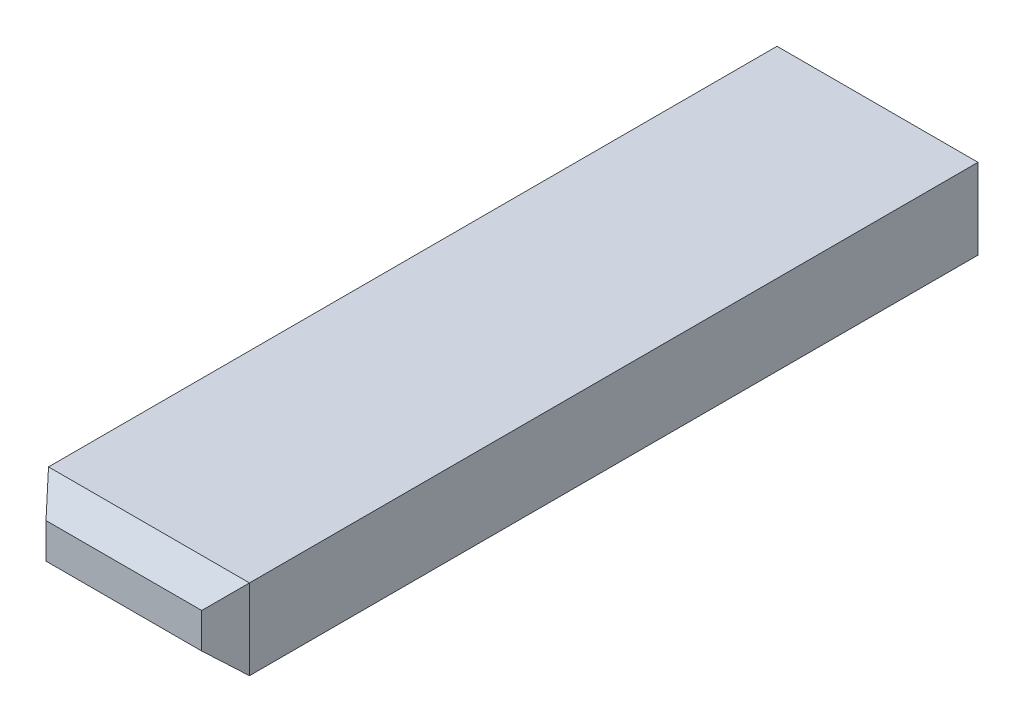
from build123d import *
from OCP.BRepFilletAPI import BRepFilletAPI_MakeChamfer

# Parameters (mm, degrees)
ESQUISSE1_W      = 4
ESQUISSE1_H      = 1.6
EXTRUSION1_DEPTH = 15
CHANFREIN1_SIZE  = 0.5
CHANFREIN1_SIZE2 = 0.450202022


with BuildPart() as part:
    # Esquisse1 → Extrusion1 (new body)
    with BuildSketch(Plane.XY):
        with Locations((2, 0.8)):
            Rectangle(ESQUISSE1_W, ESQUISSE1_H)
    extrude(amount=EXTRUSION1_DEPTH)

    # Chanfrein1: one chamfer whose edges measure the first distance from different faces: ONE call of the kernel's chamfer builder (chamfer() names one face for all edges)
    chanfrein1_edges_1 = [part.edges().sort_by_distance(p)[0] for p in [
        (4, 0.8, 15),
    ]]
    chanfrein1_side_1 = [part.faces().sort_by_distance(p)[0] for p in [
        (4, 0.8, 7.5),
    ]]
    chanfrein1_edges_2 = [part.edges().sort_by_distance(p)[0] for p in [
        (2, 1.6, 15),
    ]]
    chanfrein1_side_2 = [part.faces().sort_by_distance(p)[0] for p in [
        (2, 1.6, 7.5),
    ]]
    chanfrein1_edges_3 = [part.edges().sort_by_distance(p)[0] for p in [
        (0, 0.8, 15),
    ]]
    chanfrein1_side_3 = [part.faces().sort_by_distance(p)[0] for p in [
        (0, 0.8, 7.5),
    ]]
    chanfrein1_edges_4 = [part.edges().sort_by_distance(p)[0] for p in [
        (2, 0, 15),
    ]]
    chanfrein1_side_4 = [part.faces().sort_by_distance(p)[0] for p in [
        (2, 0, 7.5),
    ]]
    chanfrein1 = BRepFilletAPI_MakeChamfer(part.part.solid().wrapped)
    for e in chanfrein1_edges_1:
        chanfrein1.Add(CHANFREIN1_SIZE, CHANFREIN1_SIZE2, e.wrapped, chanfrein1_side_1[0].wrapped)  # the first distance lies on this face
    for e in chanfrein1_edges_2:
        chanfrein1.Add(CHANFREIN1_SIZE, CHANFREIN1_SIZE2, e.wrapped, chanfrein1_side_2[0].wrapped)  # the first distance lies on this face
    for e in chanfrein1_edges_3:
        chanfrein1.Add(CHANFREIN1_SIZE, CHANFREIN1_SIZE2, e.wrapped, chanfrein1_side_3[0].wrapped)  # the first distance lies on this face
    for e in chanfrein1_edges_4:
        chanfrein1.Add(CHANFREIN1_SIZE, CHANFREIN1_SIZE2, e.wrapped, chanfrein1_side_4[0].wrapped)  # the first distance lies on this face
    add(Compound.cast(chanfrein1.Shape()), mode=Mode.REPLACE)


solid = part.part
